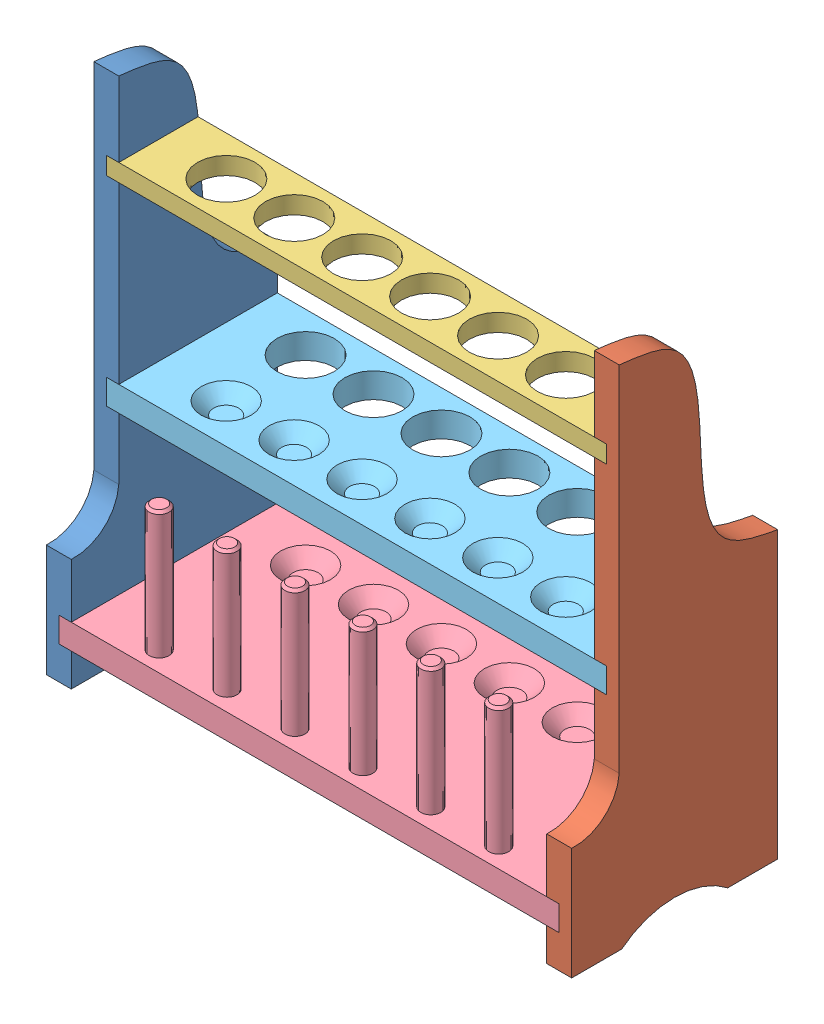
SolidWorks assembly wood-rack-v3.SLDASM, configuration Default (file format 3400). Lengths in mm.
Overall size (210.5 203.2 82.55).
5 component instances, 5 part files, 12 mates.
Components (placement in the parent):
- wood-rack-right-side-v3-1: wood-rack-right-side-v3.SLDPRT [Default] at (-54.5654 -79.1631 4.4383) size (10 203.2 82.55)
- wood-rack-left-side-v3-1: wood-rack-left-side-v3.SLDPRT [Default] at (145.9346 -79.1631 4.4383) size (10 203.2 82.55)
- wood-rack-top-v3-1: wood-rack-top-v3.SLDPRT [Default] at (22.999 87.0369 27.3765) size (200.5 7 31.75)
- wood-rack-bottom-v3-1: wood-rack-bottom-v3.SLDPRT [Default] at (69.9485 -55.9631 17.8515) x (-1 0 0) z (0 0 -1) size (200.5 60.8 82.55)
- wood-rack-middle-v3-1: wood-rack-middle-v3.SLDPRT [Default] at (90.7103 7.0369 -5.4835) x (-1 0 0) z (0 0 -1) size (200.5 10 63.5)
Mates (geometry in assembly coordinates):
- Coincident29: coincident anti-aligned: plane of ?; plane of ?
- Coincident30: coincident anti-aligned: plane of ?; plane of ?
- Coincident31: coincident aligned: plane of ?; plane of ?
- Coincident32: coincident aligned: plane of ?; plane of ?
- Coincident33: coincident anti-aligned: plane of ?; plane of ?
- Coincident34: coincident anti-aligned: plane of ?; plane of ?
- Coincident35: coincident: plane of ?; plane of ?
- Coincident36: coincident: plane of ?; plane of ?
- Coincident38: coincident aligned: plane of ?; plane of ?
- Coincident39: coincident: plane of ?; plane of ?
- Coincident40: coincident: plane of ?; plane of ?
- Coincident41: coincident aligned: plane of ?; plane of ?
